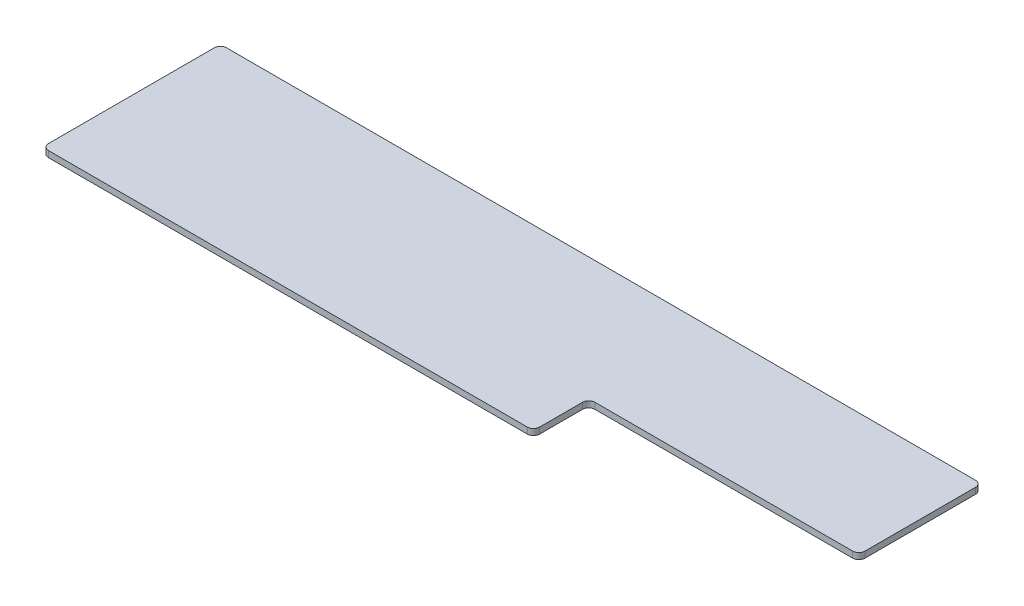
ISO-10303-21;
HEADER;
FILE_DESCRIPTION(('STEP AP214'),'2;1');
FILE_NAME('part.step','',(''),(''),'','','');
FILE_SCHEMA(('AUTOMOTIVE_DESIGN { 1 0 10303 214 1 1 1 1 }'));
ENDSEC;
DATA;
#1=APPLICATION_CONTEXT('core data for automotive mechanical design processes');
#2=APPLICATION_PROTOCOL_DEFINITION('international standard','automotive_design',2000,#1);
#3=PRODUCT_CONTEXT('',#1,'mechanical');
#4=PRODUCT('Part','Part','',(#3));
#5=PRODUCT_RELATED_PRODUCT_CATEGORY('part','',(#4));
#6=PRODUCT_DEFINITION_FORMATION('','',#4);
#7=PRODUCT_DEFINITION_CONTEXT('part definition',#1,'design');
#8=PRODUCT_DEFINITION('design','',#6,#7);
#9=PRODUCT_DEFINITION_SHAPE('','',#8);
#10=(LENGTH_UNIT() NAMED_UNIT(*) SI_UNIT(.MILLI.,.METRE.));
#11=(NAMED_UNIT(*) PLANE_ANGLE_UNIT() SI_UNIT($,.RADIAN.));
#12=(NAMED_UNIT(*) SI_UNIT($,.STERADIAN.) SOLID_ANGLE_UNIT());
#13=UNCERTAINTY_MEASURE_WITH_UNIT(LENGTH_MEASURE(1.E-05),#10,'distance_accuracy_value','');
#14=(GEOMETRIC_REPRESENTATION_CONTEXT(3) GLOBAL_UNCERTAINTY_ASSIGNED_CONTEXT((#13)) GLOBAL_UNIT_ASSIGNED_CONTEXT((#10,
#11,#12)) REPRESENTATION_CONTEXT('',''));
#15=CARTESIAN_POINT('',(0.,0.,0.));
#16=DIRECTION('',(0.,0.,1.));
#17=DIRECTION('',(1.,0.,0.));
#18=AXIS2_PLACEMENT_3D('',#15,#16,#17);
#19=CARTESIAN_POINT('',(0.,-5.,100.));
#20=DIRECTION('',(1.,0.,0.));
#21=DIRECTION('',(0.,0.,-1.));
#22=AXIS2_PLACEMENT_3D('',#19,#20,#21);
#23=PLANE('',#22);
#24=DIRECTION('',(0.,0.,-1.));
#25=VECTOR('',#24,1.);
#26=CARTESIAN_POINT('',(0.,-5.,100.));
#27=LINE('',#26,#25);
#28=CARTESIAN_POINT('',(0.,-5.,95.));
#29=VERTEX_POINT('',#28);
#30=CARTESIAN_POINT('',(0.,-5.,5.));
#31=VERTEX_POINT('',#30);
#32=EDGE_CURVE('E207',#29,#31,#27,.T.);
#33=ORIENTED_EDGE('',*,*,#32,.T.);
#34=DIRECTION('',(0.,1.,0.));
#35=VECTOR('',#34,1.);
#36=CARTESIAN_POINT('',(0.,-5.,5.));
#37=LINE('',#36,#35);
#38=CARTESIAN_POINT('',(0.,0.,5.));
#39=VERTEX_POINT('',#38);
#40=EDGE_CURVE('E147',#31,#39,#37,.T.);
#41=ORIENTED_EDGE('',*,*,#40,.T.);
#42=DIRECTION('',(0.,0.,-1.));
#43=VECTOR('',#42,1.);
#44=CARTESIAN_POINT('',(0.,0.,100.));
#45=LINE('',#44,#43);
#46=CARTESIAN_POINT('',(0.,0.,95.));
#47=VERTEX_POINT('',#46);
#48=EDGE_CURVE('E131',#47,#39,#45,.T.);
#49=ORIENTED_EDGE('',*,*,#48,.F.);
#50=DIRECTION('',(0.,1.,0.));
#51=VECTOR('',#50,1.);
#52=CARTESIAN_POINT('',(0.,-5.,95.));
#53=LINE('',#52,#51);
#54=EDGE_CURVE('E144',#47,#29,#53,.F.);
#55=ORIENTED_EDGE('',*,*,#54,.T.);
#56=EDGE_LOOP('',(#33,#41,#49,#55));
#57=FACE_BOUND('',#56,.T.);
#58=ADVANCED_FACE('F38',(#57),#23,.T.);
#59=CARTESIAN_POINT('',(-220.,-5.,100.));
#60=DIRECTION('',(0.,0.,1.));
#61=DIRECTION('',(1.,0.,0.));
#62=AXIS2_PLACEMENT_3D('',#59,#60,#61);
#63=PLANE('',#62);
#64=DIRECTION('',(1.,0.,0.));
#65=VECTOR('',#64,1.);
#66=CARTESIAN_POINT('',(-220.,-5.,100.));
#67=LINE('',#66,#65);
#68=CARTESIAN_POINT('',(-215.,-5.,100.));
#69=VERTEX_POINT('',#68);
#70=CARTESIAN_POINT('',(-5.,-5.,100.));
#71=VERTEX_POINT('',#70);
#72=EDGE_CURVE('E153',#69,#71,#67,.T.);
#73=ORIENTED_EDGE('',*,*,#72,.T.);
#74=DIRECTION('',(0.,1.,0.));
#75=VECTOR('',#74,1.);
#76=CARTESIAN_POINT('',(-5.,-5.,100.));
#77=LINE('',#76,#75);
#78=CARTESIAN_POINT('',(-5.,0.,100.));
#79=VERTEX_POINT('',#78);
#80=EDGE_CURVE('E183',#71,#79,#77,.T.);
#81=ORIENTED_EDGE('',*,*,#80,.T.);
#82=DIRECTION('',(1.,0.,0.));
#83=VECTOR('',#82,1.);
#84=CARTESIAN_POINT('',(-220.,0.,100.));
#85=LINE('',#84,#83);
#86=CARTESIAN_POINT('',(-215.,0.,100.));
#87=VERTEX_POINT('',#86);
#88=EDGE_CURVE('E133',#87,#79,#85,.T.);
#89=ORIENTED_EDGE('',*,*,#88,.F.);
#90=DIRECTION('',(0.,1.,0.));
#91=VECTOR('',#90,1.);
#92=CARTESIAN_POINT('',(-215.,-5.,100.));
#93=LINE('',#92,#91);
#94=EDGE_CURVE('E181',#87,#69,#93,.F.);
#95=ORIENTED_EDGE('',*,*,#94,.T.);
#96=EDGE_LOOP('',(#73,#81,#89,#95));
#97=FACE_BOUND('',#96,.T.);
#98=ADVANCED_FACE('F205',(#97),#63,.T.);
#99=CARTESIAN_POINT('',(-220.,-5.,145.));
#100=DIRECTION('',(1.,0.,0.));
#101=DIRECTION('',(0.,0.,-1.));
#102=AXIS2_PLACEMENT_3D('',#99,#100,#101);
#103=PLANE('',#102);
#104=DIRECTION('',(0.,0.,-1.));
#105=VECTOR('',#104,1.);
#106=CARTESIAN_POINT('',(-220.,-5.,145.));
#107=LINE('',#106,#105);
#108=CARTESIAN_POINT('',(-220.,-5.,140.));
#109=VERTEX_POINT('',#108);
#110=CARTESIAN_POINT('',(-220.,-5.,105.));
#111=VERTEX_POINT('',#110);
#112=EDGE_CURVE('E158',#109,#111,#107,.T.);
#113=ORIENTED_EDGE('',*,*,#112,.T.);
#114=DIRECTION('',(0.,1.,0.));
#115=VECTOR('',#114,1.);
#116=CARTESIAN_POINT('',(-220.,0.,105.));
#117=LINE('',#116,#115);
#118=CARTESIAN_POINT('',(-220.,0.,105.));
#119=VERTEX_POINT('',#118);
#120=EDGE_CURVE('E187',#111,#119,#117,.T.);
#121=ORIENTED_EDGE('',*,*,#120,.T.);
#122=DIRECTION('',(0.,0.,-1.));
#123=VECTOR('',#122,1.);
#124=CARTESIAN_POINT('',(-220.,0.,145.));
#125=LINE('',#124,#123);
#126=CARTESIAN_POINT('',(-220.,0.,140.));
#127=VERTEX_POINT('',#126);
#128=EDGE_CURVE('E200',#127,#119,#125,.T.);
#129=ORIENTED_EDGE('',*,*,#128,.F.);
#130=DIRECTION('',(0.,1.,0.));
#131=VECTOR('',#130,1.);
#132=CARTESIAN_POINT('',(-220.,-5.,140.));
#133=LINE('',#132,#131);
#134=EDGE_CURVE('E185',#127,#109,#133,.F.);
#135=ORIENTED_EDGE('',*,*,#134,.T.);
#136=EDGE_LOOP('',(#113,#121,#129,#135));
#137=FACE_BOUND('',#136,.T.);
#138=ADVANCED_FACE('F216',(#137),#103,.T.);
#139=CARTESIAN_POINT('',(-620.,-5.,145.));
#140=DIRECTION('',(0.,0.,1.));
#141=DIRECTION('',(1.,0.,0.));
#142=AXIS2_PLACEMENT_3D('',#139,#140,#141);
#143=PLANE('',#142);
#144=DIRECTION('',(1.,0.,0.));
#145=VECTOR('',#144,1.);
#146=CARTESIAN_POINT('',(-620.,-5.,145.));
#147=LINE('',#146,#145);
#148=CARTESIAN_POINT('',(-615.,-5.,145.));
#149=VERTEX_POINT('',#148);
#150=CARTESIAN_POINT('',(-225.,-5.,145.));
#151=VERTEX_POINT('',#150);
#152=EDGE_CURVE('E218',#149,#151,#147,.T.);
#153=ORIENTED_EDGE('',*,*,#152,.T.);
#154=DIRECTION('',(0.,1.,0.));
#155=VECTOR('',#154,1.);
#156=CARTESIAN_POINT('',(-225.,-5.,145.));
#157=LINE('',#156,#155);
#158=CARTESIAN_POINT('',(-225.,0.,145.));
#159=VERTEX_POINT('',#158);
#160=EDGE_CURVE('E192',#151,#159,#157,.T.);
#161=ORIENTED_EDGE('',*,*,#160,.T.);
#162=DIRECTION('',(1.,0.,0.));
#163=VECTOR('',#162,1.);
#164=CARTESIAN_POINT('',(-620.,0.,145.));
#165=LINE('',#164,#163);
#166=CARTESIAN_POINT('',(-615.,0.,145.));
#167=VERTEX_POINT('',#166);
#168=EDGE_CURVE('E230',#167,#159,#165,.T.);
#169=ORIENTED_EDGE('',*,*,#168,.F.);
#170=DIRECTION('',(0.,1.,0.));
#171=VECTOR('',#170,1.);
#172=CARTESIAN_POINT('',(-615.,-5.,145.));
#173=LINE('',#172,#171);
#174=EDGE_CURVE('E190',#167,#149,#173,.F.);
#175=ORIENTED_EDGE('',*,*,#174,.T.);
#176=EDGE_LOOP('',(#153,#161,#169,#175));
#177=FACE_BOUND('',#176,.T.);
#178=ADVANCED_FACE('F235',(#177),#143,.T.);
#179=CARTESIAN_POINT('',(-620.,-5.,0.));
#180=DIRECTION('',(-1.,0.,0.));
#181=DIRECTION('',(0.,0.,1.));
#182=AXIS2_PLACEMENT_3D('',#179,#180,#181);
#183=PLANE('',#182);
#184=DIRECTION('',(0.,0.,1.));
#185=VECTOR('',#184,1.);
#186=CARTESIAN_POINT('',(-620.,-5.,0.));
#187=LINE('',#186,#185);
#188=CARTESIAN_POINT('',(-620.,-5.,5.00000000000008));
#189=VERTEX_POINT('',#188);
#190=CARTESIAN_POINT('',(-620.,-5.,140.));
#191=VERTEX_POINT('',#190);
#192=EDGE_CURVE('E221',#189,#191,#187,.T.);
#193=ORIENTED_EDGE('',*,*,#192,.T.);
#194=DIRECTION('',(0.,1.,0.));
#195=VECTOR('',#194,1.);
#196=CARTESIAN_POINT('',(-620.,-5.,140.));
#197=LINE('',#196,#195);
#198=CARTESIAN_POINT('',(-620.,0.,140.));
#199=VERTEX_POINT('',#198);
#200=EDGE_CURVE('E196',#191,#199,#197,.T.);
#201=ORIENTED_EDGE('',*,*,#200,.T.);
#202=DIRECTION('',(0.,0.,1.));
#203=VECTOR('',#202,1.);
#204=CARTESIAN_POINT('',(-620.,0.,0.));
#205=LINE('',#204,#203);
#206=CARTESIAN_POINT('',(-620.,0.,5.00000000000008));
#207=VERTEX_POINT('',#206);
#208=EDGE_CURVE('E227',#207,#199,#205,.T.);
#209=ORIENTED_EDGE('',*,*,#208,.F.);
#210=DIRECTION('',(0.,1.,0.));
#211=VECTOR('',#210,1.);
#212=CARTESIAN_POINT('',(-620.,-5.,5.00000000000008));
#213=LINE('',#212,#211);
#214=EDGE_CURVE('E60',#207,#189,#213,.F.);
#215=ORIENTED_EDGE('',*,*,#214,.T.);
#216=EDGE_LOOP('',(#193,#201,#209,#215));
#217=FACE_BOUND('',#216,.T.);
#218=ADVANCED_FACE('F240',(#217),#183,.T.);
#219=CARTESIAN_POINT('',(0.,-5.,0.));
#220=DIRECTION('',(0.,0.,-1.));
#221=DIRECTION('',(-1.,0.,0.));
#222=AXIS2_PLACEMENT_3D('',#219,#220,#221);
#223=PLANE('',#222);
#224=DIRECTION('',(-1.,0.,0.));
#225=VECTOR('',#224,1.);
#226=CARTESIAN_POINT('',(0.,0.,0.));
#227=LINE('',#226,#225);
#228=CARTESIAN_POINT('',(-5.,0.,0.));
#229=VERTEX_POINT('',#228);
#230=CARTESIAN_POINT('',(-615.,0.,0.));
#231=VERTEX_POINT('',#230);
#232=EDGE_CURVE('E148',#229,#231,#227,.T.);
#233=ORIENTED_EDGE('',*,*,#232,.F.);
#234=DIRECTION('',(0.,1.,0.));
#235=VECTOR('',#234,1.);
#236=CARTESIAN_POINT('',(-5.,-5.,0.));
#237=LINE('',#236,#235);
#238=CARTESIAN_POINT('',(-5.,-5.,0.));
#239=VERTEX_POINT('',#238);
#240=EDGE_CURVE('E171',#229,#239,#237,.F.);
#241=ORIENTED_EDGE('',*,*,#240,.T.);
#242=DIRECTION('',(-1.,0.,0.));
#243=VECTOR('',#242,1.);
#244=CARTESIAN_POINT('',(0.,-5.,0.));
#245=LINE('',#244,#243);
#246=CARTESIAN_POINT('',(-615.,-5.,0.));
#247=VERTEX_POINT('',#246);
#248=EDGE_CURVE('E249',#239,#247,#245,.T.);
#249=ORIENTED_EDGE('',*,*,#248,.T.);
#250=DIRECTION('',(0.,1.,0.));
#251=VECTOR('',#250,1.);
#252=CARTESIAN_POINT('',(-615.,-5.,0.));
#253=LINE('',#252,#251);
#254=EDGE_CURVE('E168',#247,#231,#253,.T.);
#255=ORIENTED_EDGE('',*,*,#254,.T.);
#256=EDGE_LOOP('',(#233,#241,#249,#255));
#257=FACE_BOUND('',#256,.T.);
#258=ADVANCED_FACE('F247',(#257),#223,.T.);
#259=CARTESIAN_POINT('',(0.,-5.,0.));
#260=DIRECTION('',(0.,1.,0.));
#261=DIRECTION('',(0.,0.,1.));
#262=AXIS2_PLACEMENT_3D('',#259,#260,#261);
#263=PLANE('',#262);
#264=ORIENTED_EDGE('',*,*,#248,.F.);
#265=CARTESIAN_POINT('',(-5.,-5.,5.));
#266=DIRECTION('',(0.,1.,0.));
#267=DIRECTION('',(0.,0.,1.));
#268=AXIS2_PLACEMENT_3D('',#265,#266,#267);
#269=CIRCLE('',#268,5.);
#270=EDGE_CURVE('E179',#239,#31,#269,.F.);
#271=ORIENTED_EDGE('',*,*,#270,.T.);
#272=ORIENTED_EDGE('',*,*,#32,.F.);
#273=CARTESIAN_POINT('',(-5.,-5.,95.));
#274=DIRECTION('',(0.,1.,0.));
#275=DIRECTION('',(0.,0.,1.));
#276=AXIS2_PLACEMENT_3D('',#273,#274,#275);
#277=CIRCLE('',#276,5.);
#278=EDGE_CURVE('E152',#29,#71,#277,.F.);
#279=ORIENTED_EDGE('',*,*,#278,.T.);
#280=ORIENTED_EDGE('',*,*,#72,.F.);
#281=CARTESIAN_POINT('',(-215.,-5.,105.));
#282=DIRECTION('',(0.,1.,0.));
#283=DIRECTION('',(0.,0.,1.));
#284=AXIS2_PLACEMENT_3D('',#281,#282,#283);
#285=CIRCLE('',#284,5.);
#286=EDGE_CURVE('E11',#69,#111,#285,.T.);
#287=ORIENTED_EDGE('',*,*,#286,.T.);
#288=ORIENTED_EDGE('',*,*,#112,.F.);
#289=CARTESIAN_POINT('',(-225.,-5.,140.));
#290=DIRECTION('',(0.,1.,0.));
#291=DIRECTION('',(0.,0.,1.));
#292=AXIS2_PLACEMENT_3D('',#289,#290,#291);
#293=CIRCLE('',#292,5.);
#294=EDGE_CURVE('E176',#109,#151,#293,.F.);
#295=ORIENTED_EDGE('',*,*,#294,.T.);
#296=ORIENTED_EDGE('',*,*,#152,.F.);
#297=CARTESIAN_POINT('',(-615.,-5.,140.));
#298=DIRECTION('',(0.,1.,0.));
#299=DIRECTION('',(0.,0.,1.));
#300=AXIS2_PLACEMENT_3D('',#297,#298,#299);
#301=CIRCLE('',#300,5.);
#302=EDGE_CURVE('E53',#149,#191,#301,.F.);
#303=ORIENTED_EDGE('',*,*,#302,.T.);
#304=ORIENTED_EDGE('',*,*,#192,.F.);
#305=CARTESIAN_POINT('',(-615.,-5.,5.00000000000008));
#306=DIRECTION('',(0.,1.,0.));
#307=DIRECTION('',(0.,0.,1.));
#308=AXIS2_PLACEMENT_3D('',#305,#306,#307);
#309=CIRCLE('',#308,5.);
#310=EDGE_CURVE('E173',#189,#247,#309,.F.);
#311=ORIENTED_EDGE('',*,*,#310,.T.);
#312=EDGE_LOOP('',(#264,#271,#272,#279,#280,#287,#288,#295,#296,#303,#304,#311));
#313=FACE_BOUND('',#312,.T.);
#314=ADVANCED_FACE('F213',(#313),#263,.F.);
#315=CARTESIAN_POINT('',(0.,0.,0.));
#316=DIRECTION('',(0.,1.,0.));
#317=DIRECTION('',(0.,0.,1.));
#318=AXIS2_PLACEMENT_3D('',#315,#316,#317);
#319=PLANE('',#318);
#320=ORIENTED_EDGE('',*,*,#48,.T.);
#321=CARTESIAN_POINT('',(-5.,0.,5.));
#322=DIRECTION('',(0.,1.,0.));
#323=DIRECTION('',(0.,0.,1.));
#324=AXIS2_PLACEMENT_3D('',#321,#322,#323);
#325=CIRCLE('',#324,5.);
#326=EDGE_CURVE('E138',#39,#229,#325,.T.);
#327=ORIENTED_EDGE('',*,*,#326,.T.);
#328=ORIENTED_EDGE('',*,*,#232,.T.);
#329=CARTESIAN_POINT('',(-615.,0.,5.00000000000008));
#330=DIRECTION('',(0.,1.,0.));
#331=DIRECTION('',(0.,0.,1.));
#332=AXIS2_PLACEMENT_3D('',#329,#330,#331);
#333=CIRCLE('',#332,5.);
#334=EDGE_CURVE('E155',#231,#207,#333,.T.);
#335=ORIENTED_EDGE('',*,*,#334,.T.);
#336=ORIENTED_EDGE('',*,*,#208,.T.);
#337=CARTESIAN_POINT('',(-615.,0.,140.));
#338=DIRECTION('',(0.,1.,0.));
#339=DIRECTION('',(0.,0.,1.));
#340=AXIS2_PLACEMENT_3D('',#337,#338,#339);
#341=CIRCLE('',#340,5.);
#342=EDGE_CURVE('E164',#199,#167,#341,.T.);
#343=ORIENTED_EDGE('',*,*,#342,.T.);
#344=ORIENTED_EDGE('',*,*,#168,.T.);
#345=CARTESIAN_POINT('',(-225.,0.,140.));
#346=DIRECTION('',(0.,1.,0.));
#347=DIRECTION('',(0.,0.,1.));
#348=AXIS2_PLACEMENT_3D('',#345,#346,#347);
#349=CIRCLE('',#348,5.);
#350=EDGE_CURVE('E139',#159,#127,#349,.T.);
#351=ORIENTED_EDGE('',*,*,#350,.T.);
#352=ORIENTED_EDGE('',*,*,#128,.T.);
#353=CARTESIAN_POINT('',(-215.,0.,105.));
#354=DIRECTION('',(0.,1.,0.));
#355=DIRECTION('',(0.,0.,1.));
#356=AXIS2_PLACEMENT_3D('',#353,#354,#355);
#357=CIRCLE('',#356,5.);
#358=EDGE_CURVE('E46',#119,#87,#357,.F.);
#359=ORIENTED_EDGE('',*,*,#358,.T.);
#360=ORIENTED_EDGE('',*,*,#88,.T.);
#361=CARTESIAN_POINT('',(-5.,0.,95.));
#362=DIRECTION('',(0.,1.,0.));
#363=DIRECTION('',(0.,0.,1.));
#364=AXIS2_PLACEMENT_3D('',#361,#362,#363);
#365=CIRCLE('',#364,5.);
#366=EDGE_CURVE('E128',#79,#47,#365,.T.);
#367=ORIENTED_EDGE('',*,*,#366,.T.);
#368=EDGE_LOOP('',(#320,#327,#328,#335,#336,#343,#344,#351,#352,#359,#360,#367));
#369=FACE_BOUND('',#368,.T.);
#370=ADVANCED_FACE('F130',(#369),#319,.T.);
#371=CARTESIAN_POINT('',(-5.,-5.,5.));
#372=DIRECTION('',(0.,1.,0.));
#373=DIRECTION('',(0.,0.,1.));
#374=AXIS2_PLACEMENT_3D('',#371,#372,#373);
#375=CYLINDRICAL_SURFACE('',#374,5.);
#376=ORIENTED_EDGE('',*,*,#270,.F.);
#377=ORIENTED_EDGE('',*,*,#240,.F.);
#378=ORIENTED_EDGE('',*,*,#326,.F.);
#379=ORIENTED_EDGE('',*,*,#40,.F.);
#380=EDGE_LOOP('',(#376,#377,#378,#379));
#381=FACE_BOUND('',#380,.T.);
#382=ADVANCED_FACE('F254',(#381),#375,.T.);
#383=CARTESIAN_POINT('',(-5.,-5.,95.));
#384=DIRECTION('',(0.,1.,0.));
#385=DIRECTION('',(0.,0.,1.));
#386=AXIS2_PLACEMENT_3D('',#383,#384,#385);
#387=CYLINDRICAL_SURFACE('',#386,5.);
#388=ORIENTED_EDGE('',*,*,#278,.F.);
#389=ORIENTED_EDGE('',*,*,#54,.F.);
#390=ORIENTED_EDGE('',*,*,#366,.F.);
#391=ORIENTED_EDGE('',*,*,#80,.F.);
#392=EDGE_LOOP('',(#388,#389,#390,#391));
#393=FACE_BOUND('',#392,.T.);
#394=ADVANCED_FACE('F151',(#393),#387,.T.);
#395=CARTESIAN_POINT('',(-215.,-5.,105.));
#396=DIRECTION('',(0.,-1.,0.));
#397=DIRECTION('',(0.,0.,-1.));
#398=AXIS2_PLACEMENT_3D('',#395,#396,#397);
#399=CYLINDRICAL_SURFACE('',#398,5.);
#400=ORIENTED_EDGE('',*,*,#286,.F.);
#401=ORIENTED_EDGE('',*,*,#94,.F.);
#402=ORIENTED_EDGE('',*,*,#358,.F.);
#403=ORIENTED_EDGE('',*,*,#120,.F.);
#404=EDGE_LOOP('',(#400,#401,#402,#403));
#405=FACE_BOUND('',#404,.T.);
#406=ADVANCED_FACE('F209',(#405),#399,.F.);
#407=CARTESIAN_POINT('',(-225.,-5.,140.));
#408=DIRECTION('',(0.,1.,0.));
#409=DIRECTION('',(0.,0.,1.));
#410=AXIS2_PLACEMENT_3D('',#407,#408,#409);
#411=CYLINDRICAL_SURFACE('',#410,5.);
#412=ORIENTED_EDGE('',*,*,#294,.F.);
#413=ORIENTED_EDGE('',*,*,#134,.F.);
#414=ORIENTED_EDGE('',*,*,#350,.F.);
#415=ORIENTED_EDGE('',*,*,#160,.F.);
#416=EDGE_LOOP('',(#412,#413,#414,#415));
#417=FACE_BOUND('',#416,.T.);
#418=ADVANCED_FACE('F309',(#417),#411,.T.);
#419=CARTESIAN_POINT('',(-615.,-5.,140.));
#420=DIRECTION('',(0.,1.,0.));
#421=DIRECTION('',(0.,0.,1.));
#422=AXIS2_PLACEMENT_3D('',#419,#420,#421);
#423=CYLINDRICAL_SURFACE('',#422,5.);
#424=ORIENTED_EDGE('',*,*,#302,.F.);
#425=ORIENTED_EDGE('',*,*,#174,.F.);
#426=ORIENTED_EDGE('',*,*,#342,.F.);
#427=ORIENTED_EDGE('',*,*,#200,.F.);
#428=EDGE_LOOP('',(#424,#425,#426,#427));
#429=FACE_BOUND('',#428,.T.);
#430=ADVANCED_FACE('F238',(#429),#423,.T.);
#431=CARTESIAN_POINT('',(-615.,-5.,5.00000000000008));
#432=DIRECTION('',(0.,1.,0.));
#433=DIRECTION('',(0.,0.,1.));
#434=AXIS2_PLACEMENT_3D('',#431,#432,#433);
#435=CYLINDRICAL_SURFACE('',#434,5.);
#436=ORIENTED_EDGE('',*,*,#310,.F.);
#437=ORIENTED_EDGE('',*,*,#214,.F.);
#438=ORIENTED_EDGE('',*,*,#334,.F.);
#439=ORIENTED_EDGE('',*,*,#254,.F.);
#440=EDGE_LOOP('',(#436,#437,#438,#439));
#441=FACE_BOUND('',#440,.T.);
#442=ADVANCED_FACE('F40',(#441),#435,.T.);
#443=CLOSED_SHELL('',(#58,#98,#138,#178,#218,#258,#314,#370,#382,#394,#406,#418,#430,#442));
#444=MANIFOLD_SOLID_BREP('B2',#443);
#445=ADVANCED_BREP_SHAPE_REPRESENTATION('',(#18,#444),#14);
#446=SHAPE_DEFINITION_REPRESENTATION(#9,#445);
ENDSEC;
END-ISO-10303-21;
